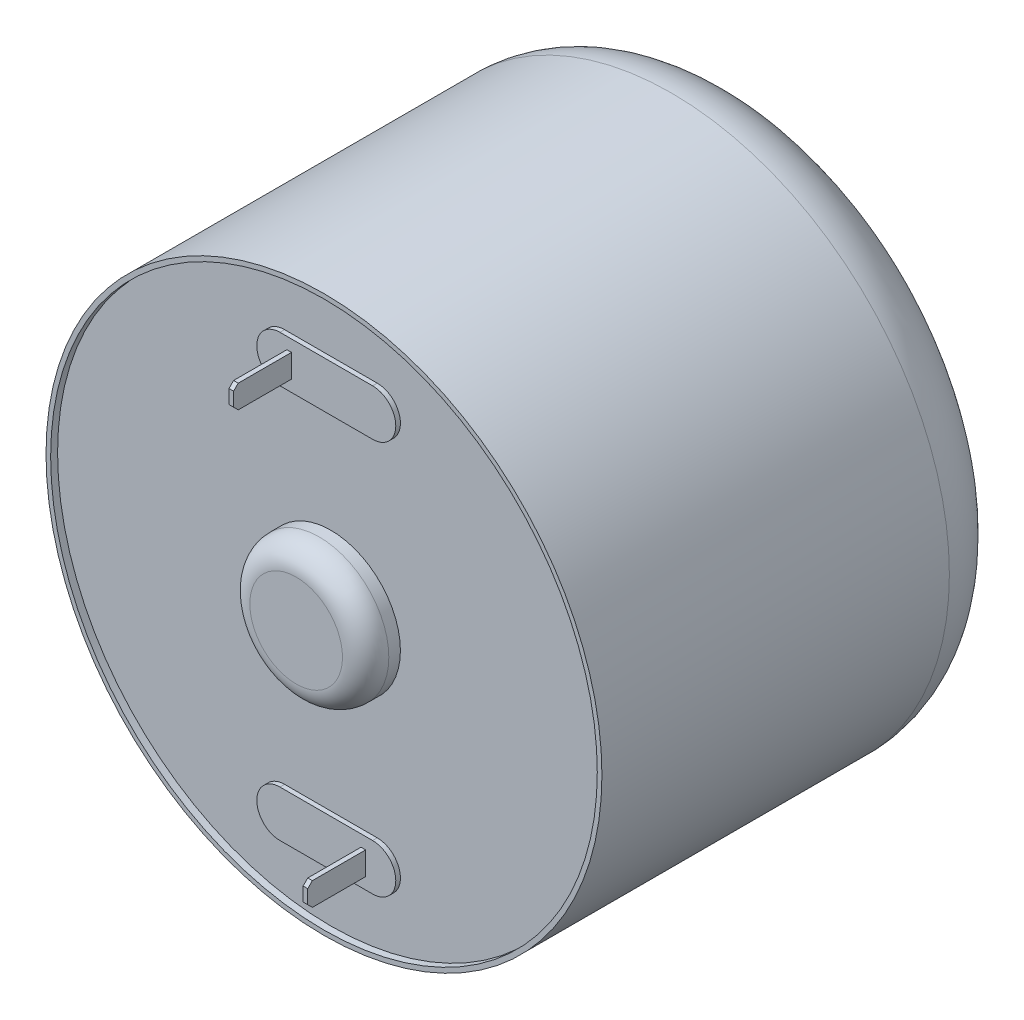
ISO-10303-21;
HEADER;
FILE_DESCRIPTION(('STEP AP214'),'2;1');
FILE_NAME('part.step','',(''),(''),'','','');
FILE_SCHEMA(('AUTOMOTIVE_DESIGN { 1 0 10303 214 1 1 1 1 }'));
ENDSEC;
DATA;
#1=APPLICATION_CONTEXT('core data for automotive mechanical design processes');
#2=APPLICATION_PROTOCOL_DEFINITION('international standard','automotive_design',2000,#1);
#3=PRODUCT_CONTEXT('',#1,'mechanical');
#4=PRODUCT('Part','Part','',(#3));
#5=PRODUCT_RELATED_PRODUCT_CATEGORY('part','',(#4));
#6=PRODUCT_DEFINITION_FORMATION('','',#4);
#7=PRODUCT_DEFINITION_CONTEXT('part definition',#1,'design');
#8=PRODUCT_DEFINITION('design','',#6,#7);
#9=PRODUCT_DEFINITION_SHAPE('','',#8);
#10=(LENGTH_UNIT() NAMED_UNIT(*) SI_UNIT(.MILLI.,.METRE.));
#11=(NAMED_UNIT(*) PLANE_ANGLE_UNIT() SI_UNIT($,.RADIAN.));
#12=(NAMED_UNIT(*) SI_UNIT($,.STERADIAN.) SOLID_ANGLE_UNIT());
#13=UNCERTAINTY_MEASURE_WITH_UNIT(LENGTH_MEASURE(1.E-05),#10,'distance_accuracy_value','');
#14=(GEOMETRIC_REPRESENTATION_CONTEXT(3) GLOBAL_UNCERTAINTY_ASSIGNED_CONTEXT((#13)) GLOBAL_UNIT_ASSIGNED_CONTEXT((#10,
#11,#12)) REPRESENTATION_CONTEXT('',''));
#15=CARTESIAN_POINT('',(0.,0.,0.));
#16=DIRECTION('',(0.,0.,1.));
#17=DIRECTION('',(1.,0.,0.));
#18=AXIS2_PLACEMENT_3D('',#15,#16,#17);
#19=CARTESIAN_POINT('',(-14.3256358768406,-6.60207496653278,17.9));
#20=DIRECTION('',(0.,0.,1.));
#21=DIRECTION('',(-1.,0.,0.));
#22=AXIS2_PLACEMENT_3D('',#19,#20,#21);
#23=PLANE('',#22);
#24=CARTESIAN_POINT('',(-14.3256358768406,-6.60207496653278,17.9));
#25=DIRECTION('',(0.,0.,1.));
#26=DIRECTION('',(-1.,0.,0.));
#27=AXIS2_PLACEMENT_3D('',#24,#25,#26);
#28=CIRCLE('',#27,1.);
#29=CARTESIAN_POINT('',(-14.3256358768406,-7.60207496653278,17.9));
#30=VERTEX_POINT('',#29);
#31=CARTESIAN_POINT('',(-14.3256358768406,-5.60207496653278,17.9));
#32=VERTEX_POINT('',#31);
#33=EDGE_CURVE('E215',#30,#32,#28,.T.);
#34=ORIENTED_EDGE('',*,*,#33,.T.);
#35=DIRECTION('',(-1.,0.,0.));
#36=VECTOR('',#35,1.);
#37=CARTESIAN_POINT('',(-14.3256358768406,-5.60207496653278,17.9));
#38=LINE('',#37,#36);
#39=CARTESIAN_POINT('',(-18.3256358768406,-5.60207496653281,17.9));
#40=VERTEX_POINT('',#39);
#41=EDGE_CURVE('E218',#32,#40,#38,.T.);
#42=ORIENTED_EDGE('',*,*,#41,.T.);
#43=CARTESIAN_POINT('',(-18.3256358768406,-6.60207496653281,17.9));
#44=DIRECTION('',(0.,0.,1.));
#45=DIRECTION('',(-1.,0.,0.));
#46=AXIS2_PLACEMENT_3D('',#43,#44,#45);
#47=CIRCLE('',#46,1.);
#48=CARTESIAN_POINT('',(-18.3256358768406,-7.60207496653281,17.9));
#49=VERTEX_POINT('',#48);
#50=EDGE_CURVE('E220',#40,#49,#47,.T.);
#51=ORIENTED_EDGE('',*,*,#50,.T.);
#52=DIRECTION('',(1.,0.,0.));
#53=VECTOR('',#52,1.);
#54=CARTESIAN_POINT('',(-14.3256358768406,-7.60207496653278,17.9));
#55=LINE('',#54,#53);
#56=EDGE_CURVE('E222',#49,#30,#55,.T.);
#57=ORIENTED_EDGE('',*,*,#56,.T.);
#58=EDGE_LOOP('',(#34,#42,#51,#57));
#59=FACE_BOUND('',#58,.T.);
#60=DIRECTION('',(-1.,0.,0.));
#61=VECTOR('',#60,1.);
#62=CARTESIAN_POINT('',(-14.6256358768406,-6.10207496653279,17.9));
#63=LINE('',#62,#61);
#64=CARTESIAN_POINT('',(-14.6256358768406,-6.10207496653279,17.9));
#65=VERTEX_POINT('',#64);
#66=CARTESIAN_POINT('',(-14.8256358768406,-6.10207496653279,17.9));
#67=VERTEX_POINT('',#66);
#68=EDGE_CURVE('E172',#65,#67,#63,.T.);
#69=ORIENTED_EDGE('',*,*,#68,.F.);
#70=DIRECTION('',(0.,1.,0.));
#71=VECTOR('',#70,1.);
#72=CARTESIAN_POINT('',(-14.6256358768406,-7.10207496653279,17.9));
#73=LINE('',#72,#71);
#74=CARTESIAN_POINT('',(-14.6256358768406,-7.10207496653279,17.9));
#75=VERTEX_POINT('',#74);
#76=EDGE_CURVE('E181',#75,#65,#73,.T.);
#77=ORIENTED_EDGE('',*,*,#76,.F.);
#78=DIRECTION('',(1.,0.,0.));
#79=VECTOR('',#78,1.);
#80=CARTESIAN_POINT('',(-14.6256358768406,-7.10207496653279,17.9));
#81=LINE('',#80,#79);
#82=CARTESIAN_POINT('',(-14.8256358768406,-7.10207496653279,17.9));
#83=VERTEX_POINT('',#82);
#84=EDGE_CURVE('E192',#83,#75,#81,.T.);
#85=ORIENTED_EDGE('',*,*,#84,.F.);
#86=DIRECTION('',(0.,-1.,0.));
#87=VECTOR('',#86,1.);
#88=CARTESIAN_POINT('',(-14.8256358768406,-7.10207496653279,17.9));
#89=LINE('',#88,#87);
#90=EDGE_CURVE('E190',#67,#83,#89,.T.);
#91=ORIENTED_EDGE('',*,*,#90,.F.);
#92=EDGE_LOOP('',(#69,#77,#85,#91));
#93=FACE_BOUND('',#92,.T.);
#94=ADVANCED_FACE('F31',(#59,#93),#23,.T.);
#95=CARTESIAN_POINT('',(-16.3256358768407,1.8979250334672,17.7));
#96=DIRECTION('',(0.,0.,1.));
#97=DIRECTION('',(1.,0.,0.));
#98=AXIS2_PLACEMENT_3D('',#95,#96,#97);
#99=PLANE('',#98);
#100=DIRECTION('',(1.,0.,0.));
#101=VECTOR('',#100,1.);
#102=CARTESIAN_POINT('',(-18.3256358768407,9.3979250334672,17.7));
#103=LINE('',#102,#101);
#104=CARTESIAN_POINT('',(-18.3256358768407,9.3979250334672,17.7));
#105=VERTEX_POINT('',#104);
#106=CARTESIAN_POINT('',(-14.3256358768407,9.3979250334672,17.7));
#107=VERTEX_POINT('',#106);
#108=EDGE_CURVE('E263',#105,#107,#103,.T.);
#109=ORIENTED_EDGE('',*,*,#108,.F.);
#110=CARTESIAN_POINT('',(-18.3256358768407,10.3979250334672,17.7));
#111=DIRECTION('',(0.,0.,1.));
#112=DIRECTION('',(1.,0.,0.));
#113=AXIS2_PLACEMENT_3D('',#110,#111,#112);
#114=CIRCLE('',#113,1.);
#115=CARTESIAN_POINT('',(-18.3256358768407,11.3979250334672,17.7));
#116=VERTEX_POINT('',#115);
#117=EDGE_CURVE('E260',#116,#105,#114,.T.);
#118=ORIENTED_EDGE('',*,*,#117,.F.);
#119=DIRECTION('',(-1.,0.,0.));
#120=VECTOR('',#119,1.);
#121=CARTESIAN_POINT('',(-18.3256358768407,11.3979250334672,17.7));
#122=LINE('',#121,#120);
#123=CARTESIAN_POINT('',(-14.3256358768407,11.3979250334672,17.7));
#124=VERTEX_POINT('',#123);
#125=EDGE_CURVE('E268',#124,#116,#122,.T.);
#126=ORIENTED_EDGE('',*,*,#125,.F.);
#127=CARTESIAN_POINT('',(-14.3256358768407,10.3979250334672,17.7));
#128=DIRECTION('',(0.,0.,1.));
#129=DIRECTION('',(1.,0.,0.));
#130=AXIS2_PLACEMENT_3D('',#127,#128,#129);
#131=CIRCLE('',#130,1.);
#132=EDGE_CURVE('E265',#107,#124,#131,.T.);
#133=ORIENTED_EDGE('',*,*,#132,.F.);
#134=EDGE_LOOP('',(#109,#118,#126,#133));
#135=FACE_BOUND('',#134,.T.);
#136=CARTESIAN_POINT('',(-16.3256358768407,1.8979250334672,17.7));
#137=DIRECTION('',(0.,0.,1.));
#138=DIRECTION('',(1.,0.,0.));
#139=AXIS2_PLACEMENT_3D('',#136,#137,#138);
#140=CIRCLE('',#139,11.8);
#141=CARTESIAN_POINT('',(-4.52563587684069,1.8979250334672,17.7));
#142=VERTEX_POINT('',#141);
#143=EDGE_CURVE('E295',#142,#142,#140,.T.);
#144=ORIENTED_EDGE('',*,*,#143,.T.);
#145=EDGE_LOOP('',(#144));
#146=FACE_BOUND('',#145,.T.);
#147=CARTESIAN_POINT('',(-16.3256358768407,1.8979250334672,17.7));
#148=DIRECTION('',(0.,0.,1.));
#149=DIRECTION('',(1.,0.,0.));
#150=AXIS2_PLACEMENT_3D('',#147,#148,#149);
#151=CIRCLE('',#150,3.);
#152=CARTESIAN_POINT('',(-13.3256358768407,1.8979250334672,17.7));
#153=VERTEX_POINT('',#152);
#154=EDGE_CURVE('E289',#153,#153,#151,.T.);
#155=ORIENTED_EDGE('',*,*,#154,.F.);
#156=EDGE_LOOP('',(#155));
#157=FACE_BOUND('',#156,.T.);
#158=DIRECTION('',(-1.,0.,0.));
#159=VECTOR('',#158,1.);
#160=CARTESIAN_POINT('',(-14.3256358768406,-5.60207496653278,17.7));
#161=LINE('',#160,#159);
#162=CARTESIAN_POINT('',(-14.3256358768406,-5.60207496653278,17.7));
#163=VERTEX_POINT('',#162);
#164=CARTESIAN_POINT('',(-18.3256358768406,-5.60207496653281,17.7));
#165=VERTEX_POINT('',#164);
#166=EDGE_CURVE('E208',#163,#165,#161,.T.);
#167=ORIENTED_EDGE('',*,*,#166,.F.);
#168=CARTESIAN_POINT('',(-14.3256358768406,-6.60207496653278,17.7));
#169=DIRECTION('',(0.,0.,1.));
#170=DIRECTION('',(-1.,0.,0.));
#171=AXIS2_PLACEMENT_3D('',#168,#169,#170);
#172=CIRCLE('',#171,1.);
#173=CARTESIAN_POINT('',(-14.3256358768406,-7.60207496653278,17.7));
#174=VERTEX_POINT('',#173);
#175=EDGE_CURVE('E177',#174,#163,#172,.T.);
#176=ORIENTED_EDGE('',*,*,#175,.F.);
#177=DIRECTION('',(1.,0.,0.));
#178=VECTOR('',#177,1.);
#179=CARTESIAN_POINT('',(-14.3256358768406,-7.60207496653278,17.7));
#180=LINE('',#179,#178);
#181=CARTESIAN_POINT('',(-18.3256358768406,-7.60207496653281,17.7));
#182=VERTEX_POINT('',#181);
#183=EDGE_CURVE('E213',#182,#174,#180,.T.);
#184=ORIENTED_EDGE('',*,*,#183,.F.);
#185=CARTESIAN_POINT('',(-18.3256358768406,-6.60207496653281,17.7));
#186=DIRECTION('',(0.,0.,1.));
#187=DIRECTION('',(-1.,0.,0.));
#188=AXIS2_PLACEMENT_3D('',#185,#186,#187);
#189=CIRCLE('',#188,1.);
#190=EDGE_CURVE('E210',#165,#182,#189,.T.);
#191=ORIENTED_EDGE('',*,*,#190,.F.);
#192=EDGE_LOOP('',(#167,#176,#184,#191));
#193=FACE_BOUND('',#192,.T.);
#194=ADVANCED_FACE('F360',(#135,#146,#157,#193),#99,.T.);
#195=CARTESIAN_POINT('',(-18.3256358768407,10.3979250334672,17.9));
#196=DIRECTION('',(0.,0.,1.));
#197=DIRECTION('',(1.,0.,0.));
#198=AXIS2_PLACEMENT_3D('',#195,#196,#197);
#199=PLANE('',#198);
#200=CARTESIAN_POINT('',(-18.3256358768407,10.3979250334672,17.9));
#201=DIRECTION('',(0.,0.,1.));
#202=DIRECTION('',(1.,0.,0.));
#203=AXIS2_PLACEMENT_3D('',#200,#201,#202);
#204=CIRCLE('',#203,1.);
#205=CARTESIAN_POINT('',(-18.3256358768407,11.3979250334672,17.9));
#206=VERTEX_POINT('',#205);
#207=CARTESIAN_POINT('',(-18.3256358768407,9.3979250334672,17.9));
#208=VERTEX_POINT('',#207);
#209=EDGE_CURVE('E270',#206,#208,#204,.T.);
#210=ORIENTED_EDGE('',*,*,#209,.T.);
#211=DIRECTION('',(1.,0.,0.));
#212=VECTOR('',#211,1.);
#213=CARTESIAN_POINT('',(-18.3256358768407,9.3979250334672,17.9));
#214=LINE('',#213,#212);
#215=CARTESIAN_POINT('',(-14.3256358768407,9.3979250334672,17.9));
#216=VERTEX_POINT('',#215);
#217=EDGE_CURVE('E273',#208,#216,#214,.T.);
#218=ORIENTED_EDGE('',*,*,#217,.T.);
#219=CARTESIAN_POINT('',(-14.3256358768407,10.3979250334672,17.9));
#220=DIRECTION('',(0.,0.,1.));
#221=DIRECTION('',(1.,0.,0.));
#222=AXIS2_PLACEMENT_3D('',#219,#220,#221);
#223=CIRCLE('',#222,1.);
#224=CARTESIAN_POINT('',(-14.3256358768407,11.3979250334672,17.9));
#225=VERTEX_POINT('',#224);
#226=EDGE_CURVE('E275',#216,#225,#223,.T.);
#227=ORIENTED_EDGE('',*,*,#226,.T.);
#228=DIRECTION('',(-1.,0.,0.));
#229=VECTOR('',#228,1.);
#230=CARTESIAN_POINT('',(-18.3256358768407,11.3979250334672,17.9));
#231=LINE('',#230,#229);
#232=EDGE_CURVE('E277',#225,#206,#231,.T.);
#233=ORIENTED_EDGE('',*,*,#232,.T.);
#234=EDGE_LOOP('',(#210,#218,#227,#233));
#235=FACE_BOUND('',#234,.T.);
#236=DIRECTION('',(1.,0.,0.));
#237=VECTOR('',#236,1.);
#238=CARTESIAN_POINT('',(-18.0256358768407,9.8979250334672,17.9));
#239=LINE('',#238,#237);
#240=CARTESIAN_POINT('',(-18.0256358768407,9.8979250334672,17.9));
#241=VERTEX_POINT('',#240);
#242=CARTESIAN_POINT('',(-17.8256358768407,9.8979250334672,17.9));
#243=VERTEX_POINT('',#242);
#244=EDGE_CURVE('E237',#241,#243,#239,.T.);
#245=ORIENTED_EDGE('',*,*,#244,.F.);
#246=DIRECTION('',(0.,-1.,0.));
#247=VECTOR('',#246,1.);
#248=CARTESIAN_POINT('',(-18.0256358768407,10.8979250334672,17.9));
#249=LINE('',#248,#247);
#250=CARTESIAN_POINT('',(-18.0256358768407,10.8979250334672,17.9));
#251=VERTEX_POINT('',#250);
#252=EDGE_CURVE('E234',#251,#241,#249,.T.);
#253=ORIENTED_EDGE('',*,*,#252,.F.);
#254=DIRECTION('',(-1.,0.,0.));
#255=VECTOR('',#254,1.);
#256=CARTESIAN_POINT('',(-18.0256358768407,10.8979250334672,17.9));
#257=LINE('',#256,#255);
#258=CARTESIAN_POINT('',(-17.8256358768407,10.8979250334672,17.9));
#259=VERTEX_POINT('',#258);
#260=EDGE_CURVE('E243',#259,#251,#257,.T.);
#261=ORIENTED_EDGE('',*,*,#260,.F.);
#262=DIRECTION('',(0.,1.,0.));
#263=VECTOR('',#262,1.);
#264=CARTESIAN_POINT('',(-17.8256358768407,10.8979250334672,17.9));
#265=LINE('',#264,#263);
#266=EDGE_CURVE('E240',#243,#259,#265,.T.);
#267=ORIENTED_EDGE('',*,*,#266,.F.);
#268=EDGE_LOOP('',(#245,#253,#261,#267));
#269=FACE_BOUND('',#268,.T.);
#270=ADVANCED_FACE('F366',(#235,#269),#199,.T.);
#271=CARTESIAN_POINT('',(-16.3256358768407,1.8979250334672,18.));
#272=DIRECTION('',(0.,0.,-1.));
#273=DIRECTION('',(-1.,0.,0.));
#274=AXIS2_PLACEMENT_3D('',#271,#272,#273);
#275=CYLINDRICAL_SURFACE('',#274,12.);
#276=CARTESIAN_POINT('',(-16.3256358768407,1.8979250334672,3.));
#277=DIRECTION('',(0.,0.,1.));
#278=DIRECTION('',(1.,0.,0.));
#279=AXIS2_PLACEMENT_3D('',#276,#277,#278);
#280=CIRCLE('',#279,12.);
#281=CARTESIAN_POINT('',(-4.32563587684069,1.8979250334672,3.));
#282=VERTEX_POINT('',#281);
#283=EDGE_CURVE('E301',#282,#282,#280,.T.);
#284=ORIENTED_EDGE('',*,*,#283,.T.);
#285=EDGE_LOOP('',(#284));
#286=FACE_BOUND('',#285,.T.);
#287=CARTESIAN_POINT('',(-16.3256358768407,1.8979250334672,18.));
#288=DIRECTION('',(0.,0.,1.));
#289=DIRECTION('',(1.,0.,0.));
#290=AXIS2_PLACEMENT_3D('',#287,#288,#289);
#291=CIRCLE('',#290,12.);
#292=CARTESIAN_POINT('',(-4.32563587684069,1.8979250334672,18.));
#293=VERTEX_POINT('',#292);
#294=EDGE_CURVE('E298',#293,#293,#291,.T.);
#295=ORIENTED_EDGE('',*,*,#294,.F.);
#296=EDGE_LOOP('',(#295));
#297=FACE_BOUND('',#296,.T.);
#298=ADVANCED_FACE('F33',(#286,#297),#275,.T.);
#299=CARTESIAN_POINT('',(-16.3256358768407,-24.6434963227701,18.));
#300=DIRECTION('',(0.,0.,1.));
#301=DIRECTION('',(1.,0.,0.));
#302=AXIS2_PLACEMENT_3D('',#299,#300,#301);
#303=PLANE('',#302);
#304=CARTESIAN_POINT('',(-16.3256358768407,1.8979250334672,18.));
#305=DIRECTION('',(0.,0.,1.));
#306=DIRECTION('',(1.,0.,0.));
#307=AXIS2_PLACEMENT_3D('',#304,#305,#306);
#308=CIRCLE('',#307,11.8);
#309=CARTESIAN_POINT('',(-4.52563587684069,1.8979250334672,18.));
#310=VERTEX_POINT('',#309);
#311=EDGE_CURVE('E292',#310,#310,#308,.T.);
#312=ORIENTED_EDGE('',*,*,#311,.F.);
#313=EDGE_LOOP('',(#312));
#314=FACE_BOUND('',#313,.T.);
#315=ORIENTED_EDGE('',*,*,#294,.T.);
#316=EDGE_LOOP('',(#315));
#317=FACE_BOUND('',#316,.T.);
#318=ADVANCED_FACE('F457',(#314,#317),#303,.T.);
#319=CARTESIAN_POINT('',(-16.3256358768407,-24.6434963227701,0.));
#320=DIRECTION('',(0.,0.,1.));
#321=DIRECTION('',(1.,0.,0.));
#322=AXIS2_PLACEMENT_3D('',#319,#320,#321);
#323=PLANE('',#322);
#324=CARTESIAN_POINT('',(-16.3256358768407,1.8979250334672,0.));
#325=DIRECTION('',(0.,0.,1.));
#326=DIRECTION('',(1.,0.,0.));
#327=AXIS2_PLACEMENT_3D('',#324,#325,#326);
#328=CIRCLE('',#327,9.00000000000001);
#329=CARTESIAN_POINT('',(-7.32563587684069,1.8979250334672,0.));
#330=VERTEX_POINT('',#329);
#331=EDGE_CURVE('E304',#330,#330,#328,.F.);
#332=ORIENTED_EDGE('',*,*,#331,.T.);
#333=EDGE_LOOP('',(#332));
#334=FACE_BOUND('',#333,.T.);
#335=ADVANCED_FACE('F454',(#334),#323,.F.);
#336=CARTESIAN_POINT('',(-16.3256358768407,1.8979250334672,3.));
#337=DIRECTION('',(0.,0.,1.));
#338=DIRECTION('',(1.,0.,0.));
#339=AXIS2_PLACEMENT_3D('',#336,#337,#338);
#340=TOROIDAL_SURFACE('',#339,9.00000000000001,3.);
#341=ORIENTED_EDGE('',*,*,#331,.F.);
#342=EDGE_LOOP('',(#341));
#343=FACE_BOUND('',#342,.T.);
#344=ORIENTED_EDGE('',*,*,#283,.F.);
#345=EDGE_LOOP('',(#344));
#346=FACE_BOUND('',#345,.T.);
#347=ADVANCED_FACE('F450',(#343,#346),#340,.T.);
#348=CARTESIAN_POINT('',(-16.3256358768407,1.8979250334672,17.7));
#349=DIRECTION('',(0.,0.,1.));
#350=DIRECTION('',(1.,0.,0.));
#351=AXIS2_PLACEMENT_3D('',#348,#349,#350);
#352=CYLINDRICAL_SURFACE('',#351,11.8);
#353=ORIENTED_EDGE('',*,*,#143,.F.);
#354=EDGE_LOOP('',(#353));
#355=FACE_BOUND('',#354,.T.);
#356=ORIENTED_EDGE('',*,*,#311,.T.);
#357=EDGE_LOOP('',(#356));
#358=FACE_BOUND('',#357,.T.);
#359=ADVANCED_FACE('F445',(#355,#358),#352,.F.);
#360=CARTESIAN_POINT('',(-16.3256358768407,1.8979250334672,19.2));
#361=DIRECTION('',(0.,0.,-1.));
#362=DIRECTION('',(-1.,0.,0.));
#363=AXIS2_PLACEMENT_3D('',#360,#361,#362);
#364=CYLINDRICAL_SURFACE('',#363,3.);
#365=CARTESIAN_POINT('',(-16.3256358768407,1.8979250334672,18.2));
#366=DIRECTION('',(0.,0.,1.));
#367=DIRECTION('',(1.,0.,0.));
#368=AXIS2_PLACEMENT_3D('',#365,#366,#367);
#369=CIRCLE('',#368,3.);
#370=CARTESIAN_POINT('',(-13.3256358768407,1.8979250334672,18.2));
#371=VERTEX_POINT('',#370);
#372=EDGE_CURVE('E310',#371,#371,#369,.F.);
#373=ORIENTED_EDGE('',*,*,#372,.T.);
#374=EDGE_LOOP('',(#373));
#375=FACE_BOUND('',#374,.T.);
#376=ORIENTED_EDGE('',*,*,#154,.T.);
#377=EDGE_LOOP('',(#376));
#378=FACE_BOUND('',#377,.T.);
#379=ADVANCED_FACE('F442',(#375,#378),#364,.T.);
#380=CARTESIAN_POINT('',(-16.3256358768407,1.8979250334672,19.2));
#381=DIRECTION('',(0.,0.,1.));
#382=DIRECTION('',(1.,0.,0.));
#383=AXIS2_PLACEMENT_3D('',#380,#381,#382);
#384=PLANE('',#383);
#385=CARTESIAN_POINT('',(-16.3256358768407,1.8979250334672,19.2));
#386=DIRECTION('',(0.,0.,1.));
#387=DIRECTION('',(1.,0.,0.));
#388=AXIS2_PLACEMENT_3D('',#385,#386,#387);
#389=CIRCLE('',#388,2.);
#390=CARTESIAN_POINT('',(-14.3256358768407,1.8979250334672,19.2));
#391=VERTEX_POINT('',#390);
#392=EDGE_CURVE('E307',#391,#391,#389,.T.);
#393=ORIENTED_EDGE('',*,*,#392,.T.);
#394=EDGE_LOOP('',(#393));
#395=FACE_BOUND('',#394,.T.);
#396=ADVANCED_FACE('F438',(#395),#384,.T.);
#397=CARTESIAN_POINT('',(-16.3256358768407,1.8979250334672,18.2));
#398=DIRECTION('',(0.,0.,1.));
#399=DIRECTION('',(1.,0.,0.));
#400=AXIS2_PLACEMENT_3D('',#397,#398,#399);
#401=TOROIDAL_SURFACE('',#400,2.,1.);
#402=ORIENTED_EDGE('',*,*,#372,.F.);
#403=EDGE_LOOP('',(#402));
#404=FACE_BOUND('',#403,.T.);
#405=ORIENTED_EDGE('',*,*,#392,.F.);
#406=EDGE_LOOP('',(#405));
#407=FACE_BOUND('',#406,.T.);
#408=ADVANCED_FACE('F434',(#404,#407),#401,.T.);
#409=CARTESIAN_POINT('',(-18.3256358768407,10.3979250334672,17.9));
#410=DIRECTION('',(0.,0.,-1.));
#411=DIRECTION('',(-1.,0.,0.));
#412=AXIS2_PLACEMENT_3D('',#409,#410,#411);
#413=CYLINDRICAL_SURFACE('',#412,1.);
#414=ORIENTED_EDGE('',*,*,#117,.T.);
#415=DIRECTION('',(0.,0.,-1.));
#416=VECTOR('',#415,1.);
#417=CARTESIAN_POINT('',(-18.3256358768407,9.3979250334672,17.9));
#418=LINE('',#417,#416);
#419=EDGE_CURVE('E287',#208,#105,#418,.T.);
#420=ORIENTED_EDGE('',*,*,#419,.F.);
#421=ORIENTED_EDGE('',*,*,#209,.F.);
#422=DIRECTION('',(0.,0.,-1.));
#423=VECTOR('',#422,1.);
#424=CARTESIAN_POINT('',(-18.3256358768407,11.3979250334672,17.9));
#425=LINE('',#424,#423);
#426=EDGE_CURVE('E279',#206,#116,#425,.T.);
#427=ORIENTED_EDGE('',*,*,#426,.T.);
#428=EDGE_LOOP('',(#414,#420,#421,#427));
#429=FACE_BOUND('',#428,.T.);
#430=ADVANCED_FACE('F430',(#429),#413,.T.);
#431=CARTESIAN_POINT('',(-18.3256358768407,9.3979250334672,17.9));
#432=DIRECTION('',(0.,1.,0.));
#433=DIRECTION('',(0.,0.,1.));
#434=AXIS2_PLACEMENT_3D('',#431,#432,#433);
#435=PLANE('',#434);
#436=ORIENTED_EDGE('',*,*,#108,.T.);
#437=DIRECTION('',(0.,0.,-1.));
#438=VECTOR('',#437,1.);
#439=CARTESIAN_POINT('',(-14.3256358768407,9.3979250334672,17.9));
#440=LINE('',#439,#438);
#441=EDGE_CURVE('E284',#216,#107,#440,.T.);
#442=ORIENTED_EDGE('',*,*,#441,.F.);
#443=ORIENTED_EDGE('',*,*,#217,.F.);
#444=ORIENTED_EDGE('',*,*,#419,.T.);
#445=EDGE_LOOP('',(#436,#442,#443,#444));
#446=FACE_BOUND('',#445,.T.);
#447=ADVANCED_FACE('F426',(#446),#435,.F.);
#448=CARTESIAN_POINT('',(-14.3256358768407,10.3979250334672,17.9));
#449=DIRECTION('',(0.,0.,-1.));
#450=DIRECTION('',(-1.,0.,0.));
#451=AXIS2_PLACEMENT_3D('',#448,#449,#450);
#452=CYLINDRICAL_SURFACE('',#451,1.);
#453=ORIENTED_EDGE('',*,*,#132,.T.);
#454=DIRECTION('',(0.,0.,-1.));
#455=VECTOR('',#454,1.);
#456=CARTESIAN_POINT('',(-14.3256358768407,11.3979250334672,17.9));
#457=LINE('',#456,#455);
#458=EDGE_CURVE('E282',#225,#124,#457,.T.);
#459=ORIENTED_EDGE('',*,*,#458,.F.);
#460=ORIENTED_EDGE('',*,*,#226,.F.);
#461=ORIENTED_EDGE('',*,*,#441,.T.);
#462=EDGE_LOOP('',(#453,#459,#460,#461));
#463=FACE_BOUND('',#462,.T.);
#464=ADVANCED_FACE('F422',(#463),#452,.T.);
#465=CARTESIAN_POINT('',(-18.3256358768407,11.3979250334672,17.9));
#466=DIRECTION('',(0.,-1.,0.));
#467=DIRECTION('',(0.,0.,-1.));
#468=AXIS2_PLACEMENT_3D('',#465,#466,#467);
#469=PLANE('',#468);
#470=ORIENTED_EDGE('',*,*,#125,.T.);
#471=ORIENTED_EDGE('',*,*,#426,.F.);
#472=ORIENTED_EDGE('',*,*,#232,.F.);
#473=ORIENTED_EDGE('',*,*,#458,.T.);
#474=EDGE_LOOP('',(#470,#471,#472,#473));
#475=FACE_BOUND('',#474,.T.);
#476=ADVANCED_FACE('F415',(#475),#469,.F.);
#477=CARTESIAN_POINT('',(-18.0256358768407,10.8979250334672,20.4));
#478=DIRECTION('',(1.,0.,0.));
#479=DIRECTION('',(0.,0.,-1.));
#480=AXIS2_PLACEMENT_3D('',#477,#478,#479);
#481=PLANE('',#480);
#482=DIRECTION('',(0.,-1.,0.));
#483=VECTOR('',#482,1.);
#484=CARTESIAN_POINT('',(-18.0256358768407,10.8979250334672,20.4));
#485=LINE('',#484,#483);
#486=CARTESIAN_POINT('',(-18.0256358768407,10.6979250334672,20.4));
#487=VERTEX_POINT('',#486);
#488=CARTESIAN_POINT('',(-18.0256358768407,10.0979250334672,20.4));
#489=VERTEX_POINT('',#488);
#490=EDGE_CURVE('E246',#487,#489,#485,.T.);
#491=ORIENTED_EDGE('',*,*,#490,.F.);
#492=DIRECTION('',(0.,0.707106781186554,-0.707106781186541));
#493=VECTOR('',#492,1.);
#494=CARTESIAN_POINT('',(-18.0256358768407,10.6979250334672,20.4));
#495=LINE('',#494,#493);
#496=CARTESIAN_POINT('',(-18.0256358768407,10.8979250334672,20.2));
#497=VERTEX_POINT('',#496);
#498=EDGE_CURVE('E321',#487,#497,#495,.T.);
#499=ORIENTED_EDGE('',*,*,#498,.T.);
#500=DIRECTION('',(0.,0.,-1.));
#501=VECTOR('',#500,1.);
#502=CARTESIAN_POINT('',(-18.0256358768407,10.8979250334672,20.4));
#503=LINE('',#502,#501);
#504=EDGE_CURVE('E252',#497,#251,#503,.T.);
#505=ORIENTED_EDGE('',*,*,#504,.T.);
#506=ORIENTED_EDGE('',*,*,#252,.T.);
#507=DIRECTION('',(0.,0.,-1.));
#508=VECTOR('',#507,1.);
#509=CARTESIAN_POINT('',(-18.0256358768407,9.8979250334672,20.4));
#510=LINE('',#509,#508);
#511=CARTESIAN_POINT('',(-18.0256358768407,9.8979250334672,20.2));
#512=VERTEX_POINT('',#511);
#513=EDGE_CURVE('E258',#512,#241,#510,.T.);
#514=ORIENTED_EDGE('',*,*,#513,.F.);
#515=DIRECTION('',(0.,0.707106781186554,0.707106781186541));
#516=VECTOR('',#515,1.);
#517=CARTESIAN_POINT('',(-18.0256358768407,10.0979250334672,20.4));
#518=LINE('',#517,#516);
#519=EDGE_CURVE('E319',#512,#489,#518,.T.);
#520=ORIENTED_EDGE('',*,*,#519,.T.);
#521=EDGE_LOOP('',(#491,#499,#505,#506,#514,#520));
#522=FACE_BOUND('',#521,.T.);
#523=ADVANCED_FACE('F411',(#522),#481,.F.);
#524=CARTESIAN_POINT('',(-18.0256358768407,9.8979250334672,20.4));
#525=DIRECTION('',(0.,1.,0.));
#526=DIRECTION('',(0.,0.,1.));
#527=AXIS2_PLACEMENT_3D('',#524,#525,#526);
#528=PLANE('',#527);
#529=DIRECTION('',(0.,0.,-1.));
#530=VECTOR('',#529,1.);
#531=CARTESIAN_POINT('',(-17.8256358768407,9.8979250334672,20.4));
#532=LINE('',#531,#530);
#533=CARTESIAN_POINT('',(-17.8256358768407,9.8979250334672,20.2));
#534=VERTEX_POINT('',#533);
#535=EDGE_CURVE('E256',#534,#243,#532,.T.);
#536=ORIENTED_EDGE('',*,*,#535,.F.);
#537=DIRECTION('',(-1.,0.,0.));
#538=VECTOR('',#537,1.);
#539=CARTESIAN_POINT('',(-18.0256358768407,9.8979250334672,20.2));
#540=LINE('',#539,#538);
#541=EDGE_CURVE('E329',#534,#512,#540,.T.);
#542=ORIENTED_EDGE('',*,*,#541,.T.);
#543=ORIENTED_EDGE('',*,*,#513,.T.);
#544=ORIENTED_EDGE('',*,*,#244,.T.);
#545=EDGE_LOOP('',(#536,#542,#543,#544));
#546=FACE_BOUND('',#545,.T.);
#547=ADVANCED_FACE('F407',(#546),#528,.F.);
#548=CARTESIAN_POINT('',(-17.8256358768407,10.8979250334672,20.4));
#549=DIRECTION('',(-1.,0.,0.));
#550=DIRECTION('',(0.,0.,1.));
#551=AXIS2_PLACEMENT_3D('',#548,#549,#550);
#552=PLANE('',#551);
#553=DIRECTION('',(0.,0.,-1.));
#554=VECTOR('',#553,1.);
#555=CARTESIAN_POINT('',(-17.8256358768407,10.8979250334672,20.4));
#556=LINE('',#555,#554);
#557=CARTESIAN_POINT('',(-17.8256358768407,10.8979250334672,20.2));
#558=VERTEX_POINT('',#557);
#559=EDGE_CURVE('E254',#558,#259,#556,.T.);
#560=ORIENTED_EDGE('',*,*,#559,.F.);
#561=DIRECTION('',(0.,-0.707106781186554,0.707106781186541));
#562=VECTOR('',#561,1.);
#563=CARTESIAN_POINT('',(-17.8256358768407,10.6979250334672,20.4));
#564=LINE('',#563,#562);
#565=CARTESIAN_POINT('',(-17.8256358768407,10.6979250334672,20.4));
#566=VERTEX_POINT('',#565);
#567=EDGE_CURVE('E327',#558,#566,#564,.T.);
#568=ORIENTED_EDGE('',*,*,#567,.T.);
#569=DIRECTION('',(0.,1.,0.));
#570=VECTOR('',#569,1.);
#571=CARTESIAN_POINT('',(-17.8256358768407,10.8979250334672,20.4));
#572=LINE('',#571,#570);
#573=CARTESIAN_POINT('',(-17.8256358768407,10.0979250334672,20.4));
#574=VERTEX_POINT('',#573);
#575=EDGE_CURVE('E249',#574,#566,#572,.T.);
#576=ORIENTED_EDGE('',*,*,#575,.F.);
#577=DIRECTION('',(0.,-0.707106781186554,-0.707106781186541));
#578=VECTOR('',#577,1.);
#579=CARTESIAN_POINT('',(-17.8256358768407,10.0979250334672,20.4));
#580=LINE('',#579,#578);
#581=EDGE_CURVE('E325',#574,#534,#580,.T.);
#582=ORIENTED_EDGE('',*,*,#581,.T.);
#583=ORIENTED_EDGE('',*,*,#535,.T.);
#584=ORIENTED_EDGE('',*,*,#266,.T.);
#585=EDGE_LOOP('',(#560,#568,#576,#582,#583,#584));
#586=FACE_BOUND('',#585,.T.);
#587=ADVANCED_FACE('F403',(#586),#552,.F.);
#588=CARTESIAN_POINT('',(-18.0256358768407,10.8979250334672,20.4));
#589=DIRECTION('',(0.,-1.,0.));
#590=DIRECTION('',(0.,0.,-1.));
#591=AXIS2_PLACEMENT_3D('',#588,#589,#590);
#592=PLANE('',#591);
#593=ORIENTED_EDGE('',*,*,#504,.F.);
#594=DIRECTION('',(1.,0.,0.));
#595=VECTOR('',#594,1.);
#596=CARTESIAN_POINT('',(-17.8256358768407,10.8979250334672,20.2));
#597=LINE('',#596,#595);
#598=EDGE_CURVE('E323',#497,#558,#597,.T.);
#599=ORIENTED_EDGE('',*,*,#598,.T.);
#600=ORIENTED_EDGE('',*,*,#559,.T.);
#601=ORIENTED_EDGE('',*,*,#260,.T.);
#602=EDGE_LOOP('',(#593,#599,#600,#601));
#603=FACE_BOUND('',#602,.T.);
#604=ADVANCED_FACE('F399',(#603),#592,.F.);
#605=CARTESIAN_POINT('',(-18.0256358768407,9.8979250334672,20.4));
#606=DIRECTION('',(0.,0.,1.));
#607=DIRECTION('',(1.,0.,0.));
#608=AXIS2_PLACEMENT_3D('',#605,#606,#607);
#609=PLANE('',#608);
#610=ORIENTED_EDGE('',*,*,#575,.T.);
#611=DIRECTION('',(-1.,0.,0.));
#612=VECTOR('',#611,1.);
#613=CARTESIAN_POINT('',(-18.0256358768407,10.6979250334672,20.4));
#614=LINE('',#613,#612);
#615=EDGE_CURVE('E316',#566,#487,#614,.T.);
#616=ORIENTED_EDGE('',*,*,#615,.T.);
#617=ORIENTED_EDGE('',*,*,#490,.T.);
#618=DIRECTION('',(1.,0.,0.));
#619=VECTOR('',#618,1.);
#620=CARTESIAN_POINT('',(-17.8256358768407,10.0979250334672,20.4));
#621=LINE('',#620,#619);
#622=EDGE_CURVE('E313',#489,#574,#621,.T.);
#623=ORIENTED_EDGE('',*,*,#622,.T.);
#624=EDGE_LOOP('',(#610,#616,#617,#623));
#625=FACE_BOUND('',#624,.T.);
#626=ADVANCED_FACE('F395',(#625),#609,.T.);
#627=CARTESIAN_POINT('',(-18.0256358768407,10.6979250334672,20.4));
#628=DIRECTION('',(0.,0.707106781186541,0.707106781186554));
#629=DIRECTION('',(0.,-0.707106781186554,0.707106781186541));
#630=AXIS2_PLACEMENT_3D('',#627,#628,#629);
#631=PLANE('',#630);
#632=ORIENTED_EDGE('',*,*,#567,.F.);
#633=ORIENTED_EDGE('',*,*,#598,.F.);
#634=ORIENTED_EDGE('',*,*,#498,.F.);
#635=ORIENTED_EDGE('',*,*,#615,.F.);
#636=EDGE_LOOP('',(#632,#633,#634,#635));
#637=FACE_BOUND('',#636,.T.);
#638=ADVANCED_FACE('F391',(#637),#631,.T.);
#639=CARTESIAN_POINT('',(-18.0256358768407,10.0979250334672,20.4));
#640=DIRECTION('',(0.,-0.707106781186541,0.707106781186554));
#641=DIRECTION('',(0.,-0.707106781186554,-0.707106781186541));
#642=AXIS2_PLACEMENT_3D('',#639,#640,#641);
#643=PLANE('',#642);
#644=ORIENTED_EDGE('',*,*,#519,.F.);
#645=ORIENTED_EDGE('',*,*,#541,.F.);
#646=ORIENTED_EDGE('',*,*,#581,.F.);
#647=ORIENTED_EDGE('',*,*,#622,.F.);
#648=EDGE_LOOP('',(#644,#645,#646,#647));
#649=FACE_BOUND('',#648,.T.);
#650=ADVANCED_FACE('F387',(#649),#643,.T.);
#651=CARTESIAN_POINT('',(-14.3256358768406,-6.60207496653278,17.9));
#652=DIRECTION('',(0.,0.,-1.));
#653=DIRECTION('',(-1.,0.,0.));
#654=AXIS2_PLACEMENT_3D('',#651,#652,#653);
#655=CYLINDRICAL_SURFACE('',#654,1.);
#656=ORIENTED_EDGE('',*,*,#175,.T.);
#657=DIRECTION('',(0.,0.,-1.));
#658=VECTOR('',#657,1.);
#659=CARTESIAN_POINT('',(-14.3256358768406,-5.60207496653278,17.9));
#660=LINE('',#659,#658);
#661=EDGE_CURVE('E232',#32,#163,#660,.T.);
#662=ORIENTED_EDGE('',*,*,#661,.F.);
#663=ORIENTED_EDGE('',*,*,#33,.F.);
#664=DIRECTION('',(0.,0.,-1.));
#665=VECTOR('',#664,1.);
#666=CARTESIAN_POINT('',(-14.3256358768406,-7.60207496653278,17.9));
#667=LINE('',#666,#665);
#668=EDGE_CURVE('E224',#30,#174,#667,.T.);
#669=ORIENTED_EDGE('',*,*,#668,.T.);
#670=EDGE_LOOP('',(#656,#662,#663,#669));
#671=FACE_BOUND('',#670,.T.);
#672=ADVANCED_FACE('F383',(#671),#655,.T.);
#673=CARTESIAN_POINT('',(-14.3256358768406,-5.60207496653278,17.9));
#674=DIRECTION('',(0.,-1.,0.));
#675=DIRECTION('',(1.,0.,0.));
#676=AXIS2_PLACEMENT_3D('',#673,#674,#675);
#677=PLANE('',#676);
#678=ORIENTED_EDGE('',*,*,#166,.T.);
#679=DIRECTION('',(0.,0.,-1.));
#680=VECTOR('',#679,1.);
#681=CARTESIAN_POINT('',(-18.3256358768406,-5.60207496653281,17.9));
#682=LINE('',#681,#680);
#683=EDGE_CURVE('E229',#40,#165,#682,.T.);
#684=ORIENTED_EDGE('',*,*,#683,.F.);
#685=ORIENTED_EDGE('',*,*,#41,.F.);
#686=ORIENTED_EDGE('',*,*,#661,.T.);
#687=EDGE_LOOP('',(#678,#684,#685,#686));
#688=FACE_BOUND('',#687,.T.);
#689=ADVANCED_FACE('F379',(#688),#677,.F.);
#690=CARTESIAN_POINT('',(-18.3256358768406,-6.60207496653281,17.9));
#691=DIRECTION('',(0.,0.,-1.));
#692=DIRECTION('',(-1.,0.,0.));
#693=AXIS2_PLACEMENT_3D('',#690,#691,#692);
#694=CYLINDRICAL_SURFACE('',#693,1.);
#695=ORIENTED_EDGE('',*,*,#190,.T.);
#696=DIRECTION('',(0.,0.,-1.));
#697=VECTOR('',#696,1.);
#698=CARTESIAN_POINT('',(-18.3256358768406,-7.60207496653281,17.9));
#699=LINE('',#698,#697);
#700=EDGE_CURVE('E227',#49,#182,#699,.T.);
#701=ORIENTED_EDGE('',*,*,#700,.F.);
#702=ORIENTED_EDGE('',*,*,#50,.F.);
#703=ORIENTED_EDGE('',*,*,#683,.T.);
#704=EDGE_LOOP('',(#695,#701,#702,#703));
#705=FACE_BOUND('',#704,.T.);
#706=ADVANCED_FACE('F375',(#705),#694,.T.);
#707=CARTESIAN_POINT('',(-14.3256358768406,-7.60207496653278,17.9));
#708=DIRECTION('',(0.,1.,0.));
#709=DIRECTION('',(-1.,0.,0.));
#710=AXIS2_PLACEMENT_3D('',#707,#708,#709);
#711=PLANE('',#710);
#712=ORIENTED_EDGE('',*,*,#183,.T.);
#713=ORIENTED_EDGE('',*,*,#668,.F.);
#714=ORIENTED_EDGE('',*,*,#56,.F.);
#715=ORIENTED_EDGE('',*,*,#700,.T.);
#716=EDGE_LOOP('',(#712,#713,#714,#715));
#717=FACE_BOUND('',#716,.T.);
#718=ADVANCED_FACE('F372',(#717),#711,.F.);
#719=CARTESIAN_POINT('',(-14.6256358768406,-7.10207496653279,20.4));
#720=DIRECTION('',(-1.,0.,0.));
#721=DIRECTION('',(0.,-1.,0.));
#722=AXIS2_PLACEMENT_3D('',#719,#720,#721);
#723=PLANE('',#722);
#724=DIRECTION('',(0.,1.,0.));
#725=VECTOR('',#724,1.);
#726=CARTESIAN_POINT('',(-14.6256358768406,-7.10207496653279,20.4));
#727=LINE('',#726,#725);
#728=CARTESIAN_POINT('',(-14.6256358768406,-6.90207496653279,20.4));
#729=VERTEX_POINT('',#728);
#730=CARTESIAN_POINT('',(-14.6256358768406,-6.30207496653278,20.4));
#731=VERTEX_POINT('',#730);
#732=EDGE_CURVE('E196',#729,#731,#727,.T.);
#733=ORIENTED_EDGE('',*,*,#732,.F.);
#734=DIRECTION('',(0.,-0.707106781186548,-0.707106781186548));
#735=VECTOR('',#734,1.);
#736=CARTESIAN_POINT('',(-14.6256358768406,-6.90207496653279,20.4));
#737=LINE('',#736,#735);
#738=CARTESIAN_POINT('',(-14.6256358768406,-7.10207496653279,20.2));
#739=VERTEX_POINT('',#738);
#740=EDGE_CURVE('E339',#729,#739,#737,.T.);
#741=ORIENTED_EDGE('',*,*,#740,.T.);
#742=DIRECTION('',(0.,0.,-1.));
#743=VECTOR('',#742,1.);
#744=CARTESIAN_POINT('',(-14.6256358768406,-7.10207496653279,20.4));
#745=LINE('',#744,#743);
#746=EDGE_CURVE('E184',#739,#75,#745,.T.);
#747=ORIENTED_EDGE('',*,*,#746,.T.);
#748=ORIENTED_EDGE('',*,*,#76,.T.);
#749=DIRECTION('',(0.,0.,-1.));
#750=VECTOR('',#749,1.);
#751=CARTESIAN_POINT('',(-14.6256358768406,-6.10207496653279,20.4));
#752=LINE('',#751,#750);
#753=CARTESIAN_POINT('',(-14.6256358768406,-6.10207496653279,20.2));
#754=VERTEX_POINT('',#753);
#755=EDGE_CURVE('E168',#754,#65,#752,.T.);
#756=ORIENTED_EDGE('',*,*,#755,.F.);
#757=DIRECTION('',(0.,-0.707106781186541,0.707106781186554));
#758=VECTOR('',#757,1.);
#759=CARTESIAN_POINT('',(-14.6256358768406,-6.30207496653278,20.4));
#760=LINE('',#759,#758);
#761=EDGE_CURVE('E337',#754,#731,#760,.T.);
#762=ORIENTED_EDGE('',*,*,#761,.T.);
#763=EDGE_LOOP('',(#733,#741,#747,#748,#756,#762));
#764=FACE_BOUND('',#763,.T.);
#765=ADVANCED_FACE('F183',(#764),#723,.F.);
#766=CARTESIAN_POINT('',(-14.6256358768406,-6.10207496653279,20.4));
#767=DIRECTION('',(0.,-1.,0.));
#768=DIRECTION('',(1.,0.,0.));
#769=AXIS2_PLACEMENT_3D('',#766,#767,#768);
#770=PLANE('',#769);
#771=DIRECTION('',(0.,0.,-1.));
#772=VECTOR('',#771,1.);
#773=CARTESIAN_POINT('',(-14.8256358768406,-6.10207496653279,20.4));
#774=LINE('',#773,#772);
#775=CARTESIAN_POINT('',(-14.8256358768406,-6.10207496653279,20.2));
#776=VERTEX_POINT('',#775);
#777=EDGE_CURVE('E178',#776,#67,#774,.T.);
#778=ORIENTED_EDGE('',*,*,#777,.F.);
#779=DIRECTION('',(1.,0.,0.));
#780=VECTOR('',#779,1.);
#781=CARTESIAN_POINT('',(-14.6256358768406,-6.10207496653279,20.2));
#782=LINE('',#781,#780);
#783=EDGE_CURVE('E11',#776,#754,#782,.T.);
#784=ORIENTED_EDGE('',*,*,#783,.T.);
#785=ORIENTED_EDGE('',*,*,#755,.T.);
#786=ORIENTED_EDGE('',*,*,#68,.T.);
#787=EDGE_LOOP('',(#778,#784,#785,#786));
#788=FACE_BOUND('',#787,.T.);
#789=ADVANCED_FACE('F170',(#788),#770,.F.);
#790=CARTESIAN_POINT('',(-14.8256358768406,-7.10207496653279,20.4));
#791=DIRECTION('',(1.,0.,0.));
#792=DIRECTION('',(0.,1.,0.));
#793=AXIS2_PLACEMENT_3D('',#790,#791,#792);
#794=PLANE('',#793);
#795=DIRECTION('',(0.,0.,-1.));
#796=VECTOR('',#795,1.);
#797=CARTESIAN_POINT('',(-14.8256358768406,-7.10207496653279,20.4));
#798=LINE('',#797,#796);
#799=CARTESIAN_POINT('',(-14.8256358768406,-7.10207496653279,20.2));
#800=VERTEX_POINT('',#799);
#801=EDGE_CURVE('E203',#800,#83,#798,.T.);
#802=ORIENTED_EDGE('',*,*,#801,.F.);
#803=DIRECTION('',(0.,0.707106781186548,0.707106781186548));
#804=VECTOR('',#803,1.);
#805=CARTESIAN_POINT('',(-14.8256358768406,-6.9020749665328,20.4));
#806=LINE('',#805,#804);
#807=CARTESIAN_POINT('',(-14.8256358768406,-6.9020749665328,20.4));
#808=VERTEX_POINT('',#807);
#809=EDGE_CURVE('E39',#800,#808,#806,.T.);
#810=ORIENTED_EDGE('',*,*,#809,.T.);
#811=DIRECTION('',(0.,-1.,0.));
#812=VECTOR('',#811,1.);
#813=CARTESIAN_POINT('',(-14.8256358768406,-7.10207496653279,20.4));
#814=LINE('',#813,#812);
#815=CARTESIAN_POINT('',(-14.8256358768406,-6.30207496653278,20.4));
#816=VERTEX_POINT('',#815);
#817=EDGE_CURVE('E199',#816,#808,#814,.T.);
#818=ORIENTED_EDGE('',*,*,#817,.F.);
#819=DIRECTION('',(0.,0.707106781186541,-0.707106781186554));
#820=VECTOR('',#819,1.);
#821=CARTESIAN_POINT('',(-14.8256358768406,-6.30207496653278,20.4));
#822=LINE('',#821,#820);
#823=EDGE_CURVE('E46',#816,#776,#822,.T.);
#824=ORIENTED_EDGE('',*,*,#823,.T.);
#825=ORIENTED_EDGE('',*,*,#777,.T.);
#826=ORIENTED_EDGE('',*,*,#90,.T.);
#827=EDGE_LOOP('',(#802,#810,#818,#824,#825,#826));
#828=FACE_BOUND('',#827,.T.);
#829=ADVANCED_FACE('F343',(#828),#794,.F.);
#830=CARTESIAN_POINT('',(-14.6256358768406,-7.10207496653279,20.4));
#831=DIRECTION('',(0.,1.,0.));
#832=DIRECTION('',(-1.,0.,0.));
#833=AXIS2_PLACEMENT_3D('',#830,#831,#832);
#834=PLANE('',#833);
#835=ORIENTED_EDGE('',*,*,#746,.F.);
#836=DIRECTION('',(-1.,0.,0.));
#837=VECTOR('',#836,1.);
#838=CARTESIAN_POINT('',(-14.8256358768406,-7.10207496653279,20.2));
#839=LINE('',#838,#837);
#840=EDGE_CURVE('E54',#739,#800,#839,.T.);
#841=ORIENTED_EDGE('',*,*,#840,.T.);
#842=ORIENTED_EDGE('',*,*,#801,.T.);
#843=ORIENTED_EDGE('',*,*,#84,.T.);
#844=EDGE_LOOP('',(#835,#841,#842,#843));
#845=FACE_BOUND('',#844,.T.);
#846=ADVANCED_FACE('F350',(#845),#834,.F.);
#847=CARTESIAN_POINT('',(-14.6256358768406,-6.10207496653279,20.4));
#848=DIRECTION('',(0.,0.,1.));
#849=DIRECTION('',(-1.,0.,0.));
#850=AXIS2_PLACEMENT_3D('',#847,#848,#849);
#851=PLANE('',#850);
#852=ORIENTED_EDGE('',*,*,#817,.T.);
#853=DIRECTION('',(1.,0.,0.));
#854=VECTOR('',#853,1.);
#855=CARTESIAN_POINT('',(-14.6256358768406,-6.90207496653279,20.4));
#856=LINE('',#855,#854);
#857=EDGE_CURVE('E334',#808,#729,#856,.T.);
#858=ORIENTED_EDGE('',*,*,#857,.T.);
#859=ORIENTED_EDGE('',*,*,#732,.T.);
#860=DIRECTION('',(-1.,0.,0.));
#861=VECTOR('',#860,1.);
#862=CARTESIAN_POINT('',(-14.8256358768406,-6.30207496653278,20.4));
#863=LINE('',#862,#861);
#864=EDGE_CURVE('E331',#731,#816,#863,.T.);
#865=ORIENTED_EDGE('',*,*,#864,.T.);
#866=EDGE_LOOP('',(#852,#858,#859,#865));
#867=FACE_BOUND('',#866,.T.);
#868=ADVANCED_FACE('F347',(#867),#851,.T.);
#869=CARTESIAN_POINT('',(-14.6256358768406,-6.90207496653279,20.4));
#870=DIRECTION('',(0.,-0.707106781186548,0.707106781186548));
#871=DIRECTION('',(0.,-0.707106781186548,-0.707106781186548));
#872=AXIS2_PLACEMENT_3D('',#869,#870,#871);
#873=PLANE('',#872);
#874=ORIENTED_EDGE('',*,*,#809,.F.);
#875=ORIENTED_EDGE('',*,*,#840,.F.);
#876=ORIENTED_EDGE('',*,*,#740,.F.);
#877=ORIENTED_EDGE('',*,*,#857,.F.);
#878=EDGE_LOOP('',(#874,#875,#876,#877));
#879=FACE_BOUND('',#878,.T.);
#880=ADVANCED_FACE('F349',(#879),#873,.T.);
#881=CARTESIAN_POINT('',(-14.6256358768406,-6.30207496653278,20.4));
#882=DIRECTION('',(0.,0.707106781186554,0.707106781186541));
#883=DIRECTION('',(0.,-0.707106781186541,0.707106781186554));
#884=AXIS2_PLACEMENT_3D('',#881,#882,#883);
#885=PLANE('',#884);
#886=ORIENTED_EDGE('',*,*,#761,.F.);
#887=ORIENTED_EDGE('',*,*,#783,.F.);
#888=ORIENTED_EDGE('',*,*,#823,.F.);
#889=ORIENTED_EDGE('',*,*,#864,.F.);
#890=EDGE_LOOP('',(#886,#887,#888,#889));
#891=FACE_BOUND('',#890,.T.);
#892=ADVANCED_FACE('F352',(#891),#885,.T.);
#893=CLOSED_SHELL('',(#94,#194,#270,#298,#318,#335,#347,#359,#379,#396,#408,#430,#447,#464,#476,
#523,#547,#587,#604,#626,#638,#650,#672,#689,#706,#718,#765,#789,#829,#846,#868,#880,#892));
#894=MANIFOLD_SOLID_BREP('B2',#893);
#895=ADVANCED_BREP_SHAPE_REPRESENTATION('',(#18,#894),#14);
#896=SHAPE_DEFINITION_REPRESENTATION(#9,#895);
ENDSEC;
END-ISO-10303-21;
